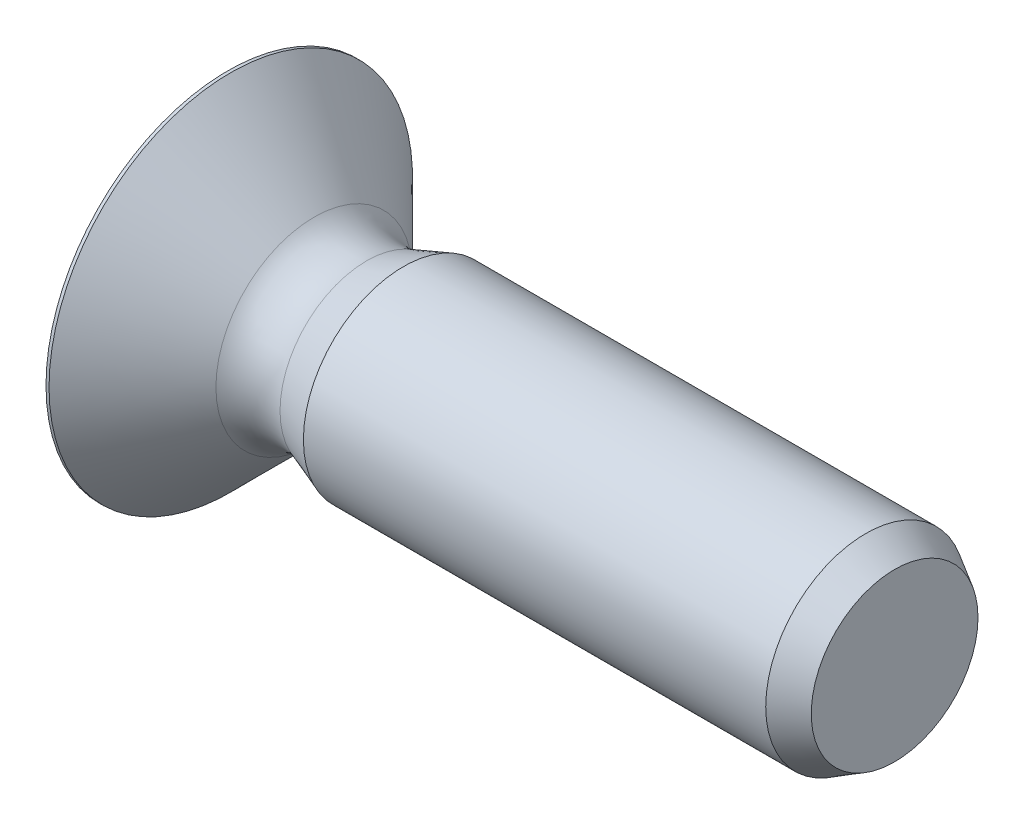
from build123d import *

# Parameters (mm, degrees)
CROSSRECESS_DEPTH = 2.725
DRAFT1_ANGLE      = -45
FILLET1_R         = 1.5


with BuildPart() as part:
    # Sketch1 → Base (revolve)
    with BuildSketch(Plane.XY, mode=Mode.PRIVATE) as base_sk:
        with BuildLine():
            Line((21.308999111, 0), (21.308999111, 3))
            Line((21.308999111, 3), (6.577940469, 3))
            Line((6.577940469, 3), (4.577940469, 2.272059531))
            Line((4.577940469, 2.272059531), (1.4, 5.45))
            Line((1.4, 5.45), (1.308999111, 5.45))
            ThreePointArc((1.308999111, 5.45), (0.331837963, 2.802497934), (0, 0))
            Line((0, 0), (21.308999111, 0))
        make_face()
    revolve(base_sk.sketch.rotate(Axis((-38.105406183, 0, 0), (1, 0, 0)), 90), axis=Axis((-38.105406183, 0, 0), (1, 0, 0)))

    # Sketch2 → BaseEnd (revolve, cut)
    with BuildSketch(Plane(origin=(0, 0, 0), x_dir=(1, 0, 0), z_dir=(0, 1, 0)), mode=Mode.PRIVATE) as baseend_sk:
        Polygon((20.442973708, -3), (21.308999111, -2.5), (21.308999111, -3), align=None)
    revolve(baseend_sk.sketch.rotate(Axis((22.637192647, 0, 0), (-1, 0, 0)), 90), axis=Axis((22.637192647, 0, 0), (-1, 0, 0)), mode=Mode.SUBTRACT)

    # Sketch3 → CrossRecess (cut)
    with BuildSketch(Plane.ZY):
        Polygon((0.73, 3.65), (-0.73, 3.65), (-0.73, 0.73), (-3.65, 0.73), (-3.65, -0.73), (-0.73, -0.73), (-0.73, -3.65), (0.73, -3.65), (0.73, -0.73), (3.65, -0.73), (3.65, 0.73), (0.73, 0.73), align=None)
    extrude(amount=-CROSSRECESS_DEPTH, mode=Mode.SUBTRACT)

    # Draft1
    draft1_faces = [part.faces().sort_by_distance(p)[0] for p in [
        (1.65066289, 0, 3.65),
        (1.65066289, 3.65, 0),
        (1.65066289, -3.65, 0),
        (1.65066289, 0, -3.65),
    ]]
    draft(draft1_faces, Plane(origin=(0, 0, 0), x_dir=(0, 0, 1), z_dir=(1, 0, 0)), DRAFT1_ANGLE)

    # Fillet1
    fillet1_edges = [part.edges().sort_by_distance(p)[0] for p in [
        (4.577940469, 0, -2.272059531),
    ]]
    fillet(fillet1_edges, radius=FILLET1_R)


solid = part.part
